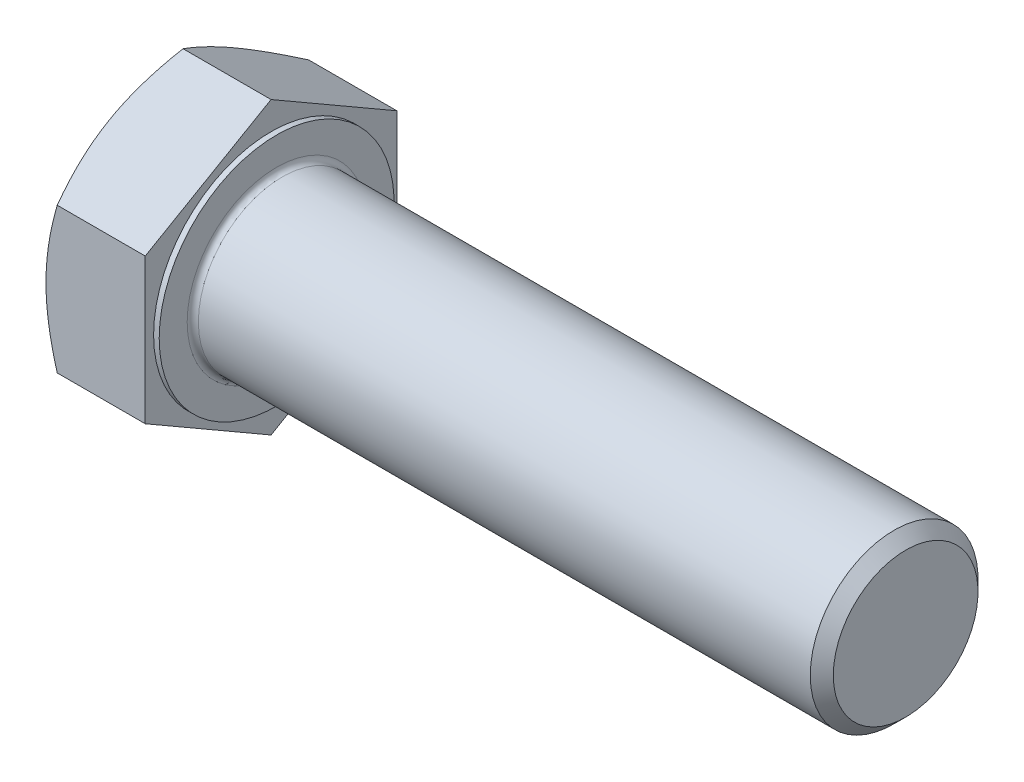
ISO-10303-21;
HEADER;
FILE_DESCRIPTION(('STEP AP214'),'2;1');
FILE_NAME('part.step','',(''),(''),'','','');
FILE_SCHEMA(('AUTOMOTIVE_DESIGN { 1 0 10303 214 1 1 1 1 }'));
ENDSEC;
DATA;
#1=APPLICATION_CONTEXT('core data for automotive mechanical design processes');
#2=APPLICATION_PROTOCOL_DEFINITION('international standard','automotive_design',2000,#1);
#3=PRODUCT_CONTEXT('',#1,'mechanical');
#4=PRODUCT('Part','Part','',(#3));
#5=PRODUCT_RELATED_PRODUCT_CATEGORY('part','',(#4));
#6=PRODUCT_DEFINITION_FORMATION('','',#4);
#7=PRODUCT_DEFINITION_CONTEXT('part definition',#1,'design');
#8=PRODUCT_DEFINITION('design','',#6,#7);
#9=PRODUCT_DEFINITION_SHAPE('','',#8);
#10=(LENGTH_UNIT() NAMED_UNIT(*) SI_UNIT(.MILLI.,.METRE.));
#11=(NAMED_UNIT(*) PLANE_ANGLE_UNIT() SI_UNIT($,.RADIAN.));
#12=(NAMED_UNIT(*) SI_UNIT($,.STERADIAN.) SOLID_ANGLE_UNIT());
#13=UNCERTAINTY_MEASURE_WITH_UNIT(LENGTH_MEASURE(1.E-05),#10,'distance_accuracy_value','');
#14=(GEOMETRIC_REPRESENTATION_CONTEXT(3) GLOBAL_UNCERTAINTY_ASSIGNED_CONTEXT((#13)) GLOBAL_UNIT_ASSIGNED_CONTEXT((#10,
#11,#12)) REPRESENTATION_CONTEXT('',''));
#15=CARTESIAN_POINT('',(0.,0.,0.));
#16=DIRECTION('',(0.,0.,1.));
#17=DIRECTION('',(1.,0.,0.));
#18=AXIS2_PLACEMENT_3D('',#15,#16,#17);
#19=CARTESIAN_POINT('',(15.,-31.1769145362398,-18.));
#20=DIRECTION('',(-1.,0.,0.));
#21=DIRECTION('',(0.,0.,1.));
#22=AXIS2_PLACEMENT_3D('',#19,#20,#21);
#23=PLANE('',#22);
#24=CARTESIAN_POINT('',(15.,0.,0.));
#25=DIRECTION('',(-1.,0.,0.));
#26=DIRECTION('',(0.,0.,1.));
#27=AXIS2_PLACEMENT_3D('',#24,#25,#26);
#28=CIRCLE('',#27,12.8);
#29=CARTESIAN_POINT('',(15.,0.,12.8));
#30=VERTEX_POINT('',#29);
#31=EDGE_CURVE('E11',#30,#30,#28,.T.);
#32=ORIENTED_EDGE('',*,*,#31,.T.);
#33=EDGE_LOOP('',(#32));
#34=FACE_BOUND('',#33,.T.);
#35=CARTESIAN_POINT('',(15.,0.,0.));
#36=DIRECTION('',(-1.,0.,0.));
#37=DIRECTION('',(0.,0.,1.));
#38=AXIS2_PLACEMENT_3D('',#35,#36,#37);
#39=CIRCLE('',#38,16.805);
#40=CARTESIAN_POINT('',(15.,0.,16.805));
#41=VERTEX_POINT('',#40);
#42=EDGE_CURVE('E274',#41,#41,#39,.T.);
#43=ORIENTED_EDGE('',*,*,#42,.F.);
#44=EDGE_LOOP('',(#43));
#45=FACE_BOUND('',#44,.T.);
#46=ADVANCED_FACE('F45',(#34,#45),#23,.F.);
#47=CARTESIAN_POINT('',(0.,0.,0.));
#48=DIRECTION('',(-1.,0.,0.));
#49=DIRECTION('',(0.,0.,1.));
#50=AXIS2_PLACEMENT_3D('',#47,#48,#49);
#51=CYLINDRICAL_SURFACE('',#50,12.);
#52=CARTESIAN_POINT('',(15.8,0.,0.));
#53=DIRECTION('',(-1.,0.,0.));
#54=DIRECTION('',(0.,0.,1.));
#55=AXIS2_PLACEMENT_3D('',#52,#53,#54);
#56=CIRCLE('',#55,12.);
#57=CARTESIAN_POINT('',(15.8,0.,12.));
#58=VERTEX_POINT('',#57);
#59=EDGE_CURVE('E53',#58,#58,#56,.F.);
#60=ORIENTED_EDGE('',*,*,#59,.T.);
#61=EDGE_LOOP('',(#60));
#62=FACE_BOUND('',#61,.T.);
#63=CARTESIAN_POINT('',(103.352,0.,0.));
#64=DIRECTION('',(-1.,0.,0.));
#65=DIRECTION('',(0.,0.,1.));
#66=AXIS2_PLACEMENT_3D('',#63,#64,#65);
#67=CIRCLE('',#66,12.);
#68=CARTESIAN_POINT('',(103.352,0.,12.));
#69=VERTEX_POINT('',#68);
#70=EDGE_CURVE('E290',#69,#69,#67,.T.);
#71=ORIENTED_EDGE('',*,*,#70,.T.);
#72=EDGE_LOOP('',(#71));
#73=FACE_BOUND('',#72,.T.);
#74=ADVANCED_FACE('F155',(#62,#73),#51,.T.);
#75=CARTESIAN_POINT('',(105.,0.,0.));
#76=DIRECTION('',(-1.,0.,0.));
#77=DIRECTION('',(0.,0.,1.));
#78=AXIS2_PLACEMENT_3D('',#75,#76,#77);
#79=PLANE('',#78);
#80=CARTESIAN_POINT('',(105.,0.,0.));
#81=DIRECTION('',(-1.,0.,0.));
#82=DIRECTION('',(0.,0.,1.));
#83=AXIS2_PLACEMENT_3D('',#80,#81,#82);
#84=CIRCLE('',#83,10.352);
#85=CARTESIAN_POINT('',(105.,0.,10.352));
#86=VERTEX_POINT('',#85);
#87=EDGE_CURVE('E312',#86,#86,#84,.T.);
#88=ORIENTED_EDGE('',*,*,#87,.F.);
#89=EDGE_LOOP('',(#88));
#90=FACE_BOUND('',#89,.T.);
#91=ADVANCED_FACE('F174',(#90),#79,.F.);
#92=CARTESIAN_POINT('',(105.,0.,0.));
#93=DIRECTION('',(-1.,0.,0.));
#94=DIRECTION('',(0.,0.,1.));
#95=AXIS2_PLACEMENT_3D('',#92,#93,#94);
#96=CONICAL_SURFACE('',#95,10.352,0.78539816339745);
#97=ORIENTED_EDGE('',*,*,#70,.F.);
#98=EDGE_LOOP('',(#97));
#99=FACE_BOUND('',#98,.T.);
#100=ORIENTED_EDGE('',*,*,#87,.T.);
#101=EDGE_LOOP('',(#100));
#102=FACE_BOUND('',#101,.T.);
#103=ADVANCED_FACE('F319',(#99,#102),#96,.T.);
#104=CARTESIAN_POINT('',(14.2,20.7846096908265,0.));
#105=DIRECTION('',(1.,0.,0.));
#106=DIRECTION('',(0.,0.,-1.));
#107=AXIS2_PLACEMENT_3D('',#104,#105,#106);
#108=PLANE('',#107);
#109=CARTESIAN_POINT('',(14.2,0.,0.));
#110=DIRECTION('',(-1.,0.,0.));
#111=DIRECTION('',(0.,0.,1.));
#112=AXIS2_PLACEMENT_3D('',#109,#110,#111);
#113=CIRCLE('',#112,16.805);
#114=CARTESIAN_POINT('',(14.2,0.,16.805));
#115=VERTEX_POINT('',#114);
#116=EDGE_CURVE('E271',#115,#115,#113,.T.);
#117=ORIENTED_EDGE('',*,*,#116,.T.);
#118=EDGE_LOOP('',(#117));
#119=FACE_BOUND('',#118,.T.);
#120=DIRECTION('',(0.,1.,0.));
#121=VECTOR('',#120,1.);
#122=CARTESIAN_POINT('',(14.2,-10.3923048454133,-18.));
#123=LINE('',#122,#121);
#124=CARTESIAN_POINT('',(14.2,-10.3923048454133,-18.));
#125=VERTEX_POINT('',#124);
#126=CARTESIAN_POINT('',(14.2,10.3923048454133,-18.));
#127=VERTEX_POINT('',#126);
#128=EDGE_CURVE('E278',#125,#127,#123,.T.);
#129=ORIENTED_EDGE('',*,*,#128,.T.);
#130=DIRECTION('',(0.,0.5,0.866025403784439));
#131=VECTOR('',#130,1.);
#132=CARTESIAN_POINT('',(14.2,10.3923048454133,-18.));
#133=LINE('',#132,#131);
#134=CARTESIAN_POINT('',(14.2,20.7846096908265,0.));
#135=VERTEX_POINT('',#134);
#136=EDGE_CURVE('E120',#127,#135,#133,.T.);
#137=ORIENTED_EDGE('',*,*,#136,.T.);
#138=DIRECTION('',(0.,-0.5,0.866025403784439));
#139=VECTOR('',#138,1.);
#140=CARTESIAN_POINT('',(14.2,20.7846096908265,0.));
#141=LINE('',#140,#139);
#142=CARTESIAN_POINT('',(14.2,10.3923048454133,18.));
#143=VERTEX_POINT('',#142);
#144=EDGE_CURVE('E115',#135,#143,#141,.T.);
#145=ORIENTED_EDGE('',*,*,#144,.T.);
#146=DIRECTION('',(0.,-1.,0.));
#147=VECTOR('',#146,1.);
#148=CARTESIAN_POINT('',(14.2,10.3923048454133,18.));
#149=LINE('',#148,#147);
#150=CARTESIAN_POINT('',(14.2,-10.3923048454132,18.));
#151=VERTEX_POINT('',#150);
#152=EDGE_CURVE('E118',#143,#151,#149,.T.);
#153=ORIENTED_EDGE('',*,*,#152,.T.);
#154=DIRECTION('',(0.,-0.5,-0.866025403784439));
#155=VECTOR('',#154,1.);
#156=CARTESIAN_POINT('',(14.2,-10.3923048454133,18.));
#157=LINE('',#156,#155);
#158=CARTESIAN_POINT('',(14.2,-20.7846096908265,0.));
#159=VERTEX_POINT('',#158);
#160=EDGE_CURVE('E60',#151,#159,#157,.T.);
#161=ORIENTED_EDGE('',*,*,#160,.T.);
#162=DIRECTION('',(0.,0.5,-0.866025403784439));
#163=VECTOR('',#162,1.);
#164=CARTESIAN_POINT('',(14.2,-20.7846096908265,0.));
#165=LINE('',#164,#163);
#166=EDGE_CURVE('E151',#159,#125,#165,.T.);
#167=ORIENTED_EDGE('',*,*,#166,.T.);
#168=EDGE_LOOP('',(#129,#137,#145,#153,#161,#167));
#169=FACE_BOUND('',#168,.T.);
#170=ADVANCED_FACE('F117',(#119,#169),#108,.T.);
#171=CARTESIAN_POINT('',(0.,0.,0.));
#172=DIRECTION('',(-1.,0.,0.));
#173=DIRECTION('',(0.,0.,1.));
#174=AXIS2_PLACEMENT_3D('',#171,#172,#173);
#175=CYLINDRICAL_SURFACE('',#174,16.805);
#176=ORIENTED_EDGE('',*,*,#42,.T.);
#177=EDGE_LOOP('',(#176));
#178=FACE_BOUND('',#177,.T.);
#179=ORIENTED_EDGE('',*,*,#116,.F.);
#180=EDGE_LOOP('',(#179));
#181=FACE_BOUND('',#180,.T.);
#182=ADVANCED_FACE('F184',(#178,#181),#175,.T.);
#183=CARTESIAN_POINT('',(0.,-31.1769145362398,-18.));
#184=DIRECTION('',(-1.,0.,0.));
#185=DIRECTION('',(0.,0.,1.));
#186=AXIS2_PLACEMENT_3D('',#183,#184,#185);
#187=PLANE('',#186);
#188=CARTESIAN_POINT('',(0.,0.,0.));
#189=DIRECTION('',(-1.,0.,0.));
#190=DIRECTION('',(0.,0.,1.));
#191=AXIS2_PLACEMENT_3D('',#188,#189,#190);
#192=CIRCLE('',#191,18.);
#193=CARTESIAN_POINT('',(0.,-15.5884572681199,9.));
#194=VERTEX_POINT('',#193);
#195=CARTESIAN_POINT('',(0.,0.,18.));
#196=VERTEX_POINT('',#195);
#197=EDGE_CURVE('E146',#194,#196,#192,.T.);
#198=ORIENTED_EDGE('',*,*,#197,.T.);
#199=CARTESIAN_POINT('',(0.,0.,0.));
#200=DIRECTION('',(-1.,0.,0.));
#201=DIRECTION('',(0.,0.,1.));
#202=AXIS2_PLACEMENT_3D('',#199,#200,#201);
#203=CIRCLE('',#202,18.);
#204=CARTESIAN_POINT('',(0.,15.5884572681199,9.));
#205=VERTEX_POINT('',#204);
#206=EDGE_CURVE('E68',#196,#205,#203,.T.);
#207=ORIENTED_EDGE('',*,*,#206,.T.);
#208=CARTESIAN_POINT('',(0.,15.5884572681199,-9.));
#209=VERTEX_POINT('',#208);
#210=EDGE_CURVE('E150',#205,#209,#192,.T.);
#211=ORIENTED_EDGE('',*,*,#210,.T.);
#212=CARTESIAN_POINT('',(0.,0.,-18.));
#213=VERTEX_POINT('',#212);
#214=EDGE_CURVE('E306',#209,#213,#192,.T.);
#215=ORIENTED_EDGE('',*,*,#214,.T.);
#216=CARTESIAN_POINT('',(0.,-15.5884572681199,-9.));
#217=VERTEX_POINT('',#216);
#218=EDGE_CURVE('E303',#213,#217,#192,.T.);
#219=ORIENTED_EDGE('',*,*,#218,.T.);
#220=EDGE_CURVE('E149',#217,#194,#192,.T.);
#221=ORIENTED_EDGE('',*,*,#220,.T.);
#222=EDGE_LOOP('',(#198,#207,#211,#215,#219,#221));
#223=FACE_BOUND('',#222,.T.);
#224=ADVANCED_FACE('F180',(#223),#187,.T.);
#225=CARTESIAN_POINT('',(0.,0.,0.));
#226=DIRECTION('',(1.,0.,0.));
#227=DIRECTION('',(0.,0.,-1.));
#228=AXIS2_PLACEMENT_3D('',#225,#226,#227);
#229=CONICAL_SURFACE('',#228,18.,1.0471975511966);
#230=CARTESIAN_POINT('',(1.60776182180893,20.7847251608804,0.000199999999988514));
#231=CARTESIAN_POINT('',(1.47589336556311,20.5563065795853,-0.395432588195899));
#232=CARTESIAN_POINT('',(1.35000889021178,20.3269970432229,-0.79260835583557));
#233=CARTESIAN_POINT('',(1.11187123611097,19.8665391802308,-1.59014476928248));
#234=CARTESIAN_POINT('',(0.999622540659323,19.6353902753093,-1.99050641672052));
#235=CARTESIAN_POINT('',(0.790265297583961,19.1708069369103,-2.79518836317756));
#236=CARTESIAN_POINT('',(0.693192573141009,18.9373684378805,-3.1995157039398));
#237=CARTESIAN_POINT('',(0.516271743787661,18.4688693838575,-4.01097986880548));
#238=CARTESIAN_POINT('',(0.43642265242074,18.2338089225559,-4.41811653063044));
#239=CARTESIAN_POINT('',(0.297345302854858,17.7680889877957,-5.22476711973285));
#240=CARTESIAN_POINT('',(0.237656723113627,17.537464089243,-5.62422116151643));
#241=CARTESIAN_POINT('',(0.13757237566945,17.0751575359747,-6.4249596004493));
#242=CARTESIAN_POINT('',(0.097176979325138,16.8434758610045,-6.82624403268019));
#243=CARTESIAN_POINT('',(0.0366989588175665,16.3797233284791,-7.62948698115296));
#244=CARTESIAN_POINT('',(0.0165921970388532,16.1476532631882,-8.03144412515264));
#245=CARTESIAN_POINT('',(-0.00287614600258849,15.6832989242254,-8.83572943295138));
#246=CARTESIAN_POINT('',(-0.00223836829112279,15.4510146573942,-9.23805758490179));
#247=CARTESIAN_POINT('',(0.0183335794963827,15.0167538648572,-9.99021934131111));
#248=CARTESIAN_POINT('',(0.0357591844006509,14.8147463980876,-10.3401065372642));
#249=CARTESIAN_POINT('',(0.0859690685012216,14.4112133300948,-11.0390463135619));
#250=CARTESIAN_POINT('',(0.118753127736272,14.209687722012,-11.3880989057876));
#251=CARTESIAN_POINT('',(0.199111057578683,13.8071947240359,-12.0852372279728));
#252=CARTESIAN_POINT('',(0.246698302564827,13.6062280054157,-12.4333217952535));
#253=CARTESIAN_POINT('',(0.355822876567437,13.2052512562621,-13.1278338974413));
#254=CARTESIAN_POINT('',(0.417360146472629,13.0052412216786,-13.4742614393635));
#255=CARTESIAN_POINT('',(0.624462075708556,12.3980849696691,-14.525886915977));
#256=CARTESIAN_POINT('',(0.790677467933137,11.99269701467,-15.228039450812));
#257=CARTESIAN_POINT('',(1.16791817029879,11.1879658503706,-16.6218747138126));
#258=CARTESIAN_POINT('',(1.37885488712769,10.78861233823,-17.3135752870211));
#259=CARTESIAN_POINT('',(1.60776182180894,10.3921893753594,-18.0002));
#260=B_SPLINE_CURVE_WITH_KNOTS('',3,(#230,#231,#232,#233,#234,#235,#236,#237,#238,#239,#240,
#241,#242,#243,#244,#245,#246,#247,#248,#249,#250,#251,#252,#253,#254,#255,#256,#257,#258,#259),
.UNSPECIFIED.,.F.,.F.,(4,2,2,2,2,2,2,2,2,2,2,2,2,2,4),(0.,1.42650335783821,2.85347447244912,
4.28376471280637,5.71397301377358,7.10888071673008,8.50381526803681,9.8970882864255,
11.2903182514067,12.5031974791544,13.7160593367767,14.9300201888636,16.1439758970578,
18.6253607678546,21.1018751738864),.UNSPECIFIED.);
#261=CARTESIAN_POINT('',(1.60769515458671,10.3923048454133,-18.));
#262=VERTEX_POINT('',#261);
#263=EDGE_CURVE('E238',#209,#262,#260,.T.);
#264=ORIENTED_EDGE('',*,*,#263,.T.);
#265=CARTESIAN_POINT('',(8.61348069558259,-27.5619239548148,-18.));
#266=CARTESIAN_POINT('',(8.42247770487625,-27.1667877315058,-18.));
#267=CARTESIAN_POINT('',(8.23246323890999,-26.7711739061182,-18.));
#268=CARTESIAN_POINT('',(7.85463825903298,-25.978890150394,-18.));
#269=CARTESIAN_POINT('',(7.66682776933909,-25.5822202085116,-18.));
#270=CARTESIAN_POINT('',(7.10698821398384,-24.3903587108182,-18.));
#271=CARTESIAN_POINT('',(6.73861331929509,-23.5934439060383,-18.));
#272=CARTESIAN_POINT('',(6.01187832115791,-21.9895471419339,-18.));
#273=CARTESIAN_POINT('',(5.65358759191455,-21.1825336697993,-18.));
#274=CARTESIAN_POINT('',(4.95238944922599,-19.5618746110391,-18.));
#275=CARTESIAN_POINT('',(4.60948123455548,-18.7482293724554,-18.));
#276=CARTESIAN_POINT('',(3.93907746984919,-17.1029123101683,-18.));
#277=CARTESIAN_POINT('',(3.611822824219,-16.2711418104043,-18.));
#278=CARTESIAN_POINT('',(2.98294292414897,-14.597784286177,-18.));
#279=CARTESIAN_POINT('',(2.68132051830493,-13.7561961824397,-18.));
#280=CARTESIAN_POINT('',(2.11181367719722,-12.0636207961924,-18.));
#281=CARTESIAN_POINT('',(1.84385751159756,-11.2126578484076,-18.));
#282=CARTESIAN_POINT('',(1.35037221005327,-9.49855213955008,-18.));
#283=CARTESIAN_POINT('',(1.12482967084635,-8.6354133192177,-18.));
#284=CARTESIAN_POINT('',(0.826582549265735,-7.33140916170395,-18.));
#285=CARTESIAN_POINT('',(0.733829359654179,-6.89509921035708,-18.));
#286=CARTESIAN_POINT('',(0.563143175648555,-6.01957542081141,-18.));
#287=CARTESIAN_POINT('',(0.485209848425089,-5.5803616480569,-18.));
#288=CARTESIAN_POINT('',(0.345545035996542,-4.6993249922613,-18.));
#289=CARTESIAN_POINT('',(0.283814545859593,-4.25750195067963,-18.));
#290=CARTESIAN_POINT('',(0.177795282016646,-3.37175302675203,-18.));
#291=CARTESIAN_POINT('',(0.133506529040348,-2.92782714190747,-18.));
#292=CARTESIAN_POINT('',(0.0635630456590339,-2.04133804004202,-18.));
#293=CARTESIAN_POINT('',(0.0377917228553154,-1.598784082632,-18.));
#294=CARTESIAN_POINT('',(0.00501858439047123,-0.71298392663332,-18.));
#295=CARTESIAN_POINT('',(-0.00198351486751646,-0.269737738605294,-18.));
#296=CARTESIAN_POINT('',(0.00294785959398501,0.616528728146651,-18.));
#297=CARTESIAN_POINT('',(0.0148760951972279,1.05954903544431,-18.));
#298=CARTESIAN_POINT('',(0.0573715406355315,1.9446967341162,-18.));
#299=CARTESIAN_POINT('',(0.0879395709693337,2.38682408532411,-18.));
#300=CARTESIAN_POINT('',(0.183949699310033,3.45808110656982,-18.));
#301=CARTESIAN_POINT('',(0.258712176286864,4.08639173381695,-18.));
#302=CARTESIAN_POINT('',(0.441718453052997,5.33809089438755,-18.));
#303=CARTESIAN_POINT('',(0.549967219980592,5.96147868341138,-18.));
#304=CARTESIAN_POINT('',(0.919513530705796,7.82534534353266,-18.));
#305=CARTESIAN_POINT('',(1.22536507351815,9.05709271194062,-18.));
#306=CARTESIAN_POINT('',(1.75275444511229,10.8995809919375,-18.));
#307=CARTESIAN_POINT('',(1.94256699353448,11.5199484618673,-18.));
#308=CARTESIAN_POINT('',(2.34111719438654,12.7546900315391,-18.));
#309=CARTESIAN_POINT('',(2.54985655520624,13.3690635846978,-18.));
#310=CARTESIAN_POINT('',(2.98181266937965,14.5887549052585,-18.));
#311=CARTESIAN_POINT('',(3.20494114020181,15.1941042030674,-18.));
#312=CARTESIAN_POINT('',(3.54929436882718,16.0983156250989,-18.));
#313=CARTESIAN_POINT('',(3.66566915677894,16.3990354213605,-18.));
#314=CARTESIAN_POINT('',(3.90137756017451,16.9993068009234,-18.));
#315=CARTESIAN_POINT('',(4.0207111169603,17.298858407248,-18.));
#316=CARTESIAN_POINT('',(4.14139052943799,17.5978664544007,-18.));
#317=B_SPLINE_CURVE_WITH_KNOTS('',3,(#265,#266,#267,#268,#269,#270,#271,#272,#273,#274,#275,
#276,#277,#278,#279,#280,#281,#282,#283,#284,#285,#286,#287,#288,#289,#290,#291,#292,#293,#294,
#295,#296,#297,#298,#299,#300,#301,#302,#303,#304,#305,#306,#307,#308,#309,#310,#311,#312,#313,
#314,#315,#316),.UNSPECIFIED.,.F.,.F.,(4,2,2,2,2,2,2,2,2,2,2,2,2,2,2,2,2,2,2,2,2,2,2,2,2,4),(0.,
1.3166344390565,2.6332833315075,5.26700924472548,7.91580691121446,10.5644664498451,
13.2456434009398,15.9271179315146,18.6027786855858,21.2775924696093,22.6155612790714,
23.9535000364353,25.2915209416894,26.6295434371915,27.9590656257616,29.2885677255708,
30.6177020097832,31.9468948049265,33.8440459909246,35.7414787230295,39.5436531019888,
41.4897689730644,43.4360606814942,45.3713764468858,46.3387197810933,47.3060439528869),.UNSPECIFIED.);
#318=EDGE_CURVE('E293',#262,#213,#317,.F.);
#319=ORIENTED_EDGE('',*,*,#318,.T.);
#320=ORIENTED_EDGE('',*,*,#214,.F.);
#321=EDGE_LOOP('',(#264,#319,#320));
#322=FACE_BOUND('',#321,.T.);
#323=ADVANCED_FACE('F183',(#322),#229,.T.);
#324=CARTESIAN_POINT('',(1.60776182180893,10.3921893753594,18.0002));
#325=CARTESIAN_POINT('',(1.47589336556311,10.6206079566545,17.6045674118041));
#326=CARTESIAN_POINT('',(1.35000889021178,10.8499174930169,17.2073916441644));
#327=CARTESIAN_POINT('',(1.11187123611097,11.310375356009,16.4098552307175));
#328=CARTESIAN_POINT('',(0.999622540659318,11.5415242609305,16.0094935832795));
#329=CARTESIAN_POINT('',(0.790265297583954,12.0061075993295,15.2048116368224));
#330=CARTESIAN_POINT('',(0.693192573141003,12.2395460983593,14.8004842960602));
#331=CARTESIAN_POINT('',(0.516271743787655,12.7080451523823,13.9890201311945));
#332=CARTESIAN_POINT('',(0.436422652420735,12.9431056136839,13.5818834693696));
#333=CARTESIAN_POINT('',(0.297345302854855,13.4088255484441,12.7752328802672));
#334=CARTESIAN_POINT('',(0.237656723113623,13.6394504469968,12.3757788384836));
#335=CARTESIAN_POINT('',(0.137572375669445,14.1017570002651,11.5750403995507));
#336=CARTESIAN_POINT('',(0.0971769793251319,14.3334386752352,11.1737559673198));
#337=CARTESIAN_POINT('',(0.0366989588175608,14.7971912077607,10.370513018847));
#338=CARTESIAN_POINT('',(0.0165921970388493,15.0292612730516,9.96855587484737));
#339=CARTESIAN_POINT('',(-0.00287614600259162,15.4936156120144,9.16427056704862));
#340=CARTESIAN_POINT('',(-0.0022383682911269,15.7258998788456,8.76194241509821));
#341=CARTESIAN_POINT('',(0.0183335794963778,16.1601606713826,8.00978065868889));
#342=CARTESIAN_POINT('',(0.0357591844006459,16.3621681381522,7.65989346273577));
#343=CARTESIAN_POINT('',(0.0859690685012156,16.765701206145,6.96095368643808));
#344=CARTESIAN_POINT('',(0.118753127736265,16.9672268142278,6.61190109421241));
#345=CARTESIAN_POINT('',(0.199111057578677,17.3697198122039,5.91476277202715));
#346=CARTESIAN_POINT('',(0.246698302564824,17.5706865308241,5.56667820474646));
#347=CARTESIAN_POINT('',(0.355822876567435,17.9716632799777,4.87216610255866));
#348=CARTESIAN_POINT('',(0.417360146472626,18.1716733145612,4.5257385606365));
#349=CARTESIAN_POINT('',(0.62446207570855,18.7788295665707,3.47411308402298));
#350=CARTESIAN_POINT('',(0.790677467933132,19.1842175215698,2.771960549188));
#351=CARTESIAN_POINT('',(1.16791817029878,19.9889486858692,1.37812528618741));
#352=CARTESIAN_POINT('',(1.37885488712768,20.3883021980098,0.686424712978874));
#353=CARTESIAN_POINT('',(1.60776182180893,20.7847251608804,-0.000200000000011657));
#354=B_SPLINE_CURVE_WITH_KNOTS('',3,(#324,#325,#326,#327,#328,#329,#330,#331,#332,#333,#334,
#335,#336,#337,#338,#339,#340,#341,#342,#343,#344,#345,#346,#347,#348,#349,#350,#351,#352,#353),
.UNSPECIFIED.,.F.,.F.,(4,2,2,2,2,2,2,2,2,2,2,2,2,2,4),(0.,1.42650335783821,2.85347447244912,
4.28376471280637,5.71397301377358,7.10888071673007,8.5038152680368,9.89708828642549,
11.2903182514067,12.5031974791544,13.7160593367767,14.9300201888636,16.1439758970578,
18.6253607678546,21.1018751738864),.UNSPECIFIED.);
#355=CARTESIAN_POINT('',(1.60769515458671,20.7846096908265,0.));
#356=VERTEX_POINT('',#355);
#357=EDGE_CURVE('E246',#205,#356,#354,.T.);
#358=ORIENTED_EDGE('',*,*,#357,.T.);
#359=EDGE_CURVE('E245',#356,#209,#260,.T.);
#360=ORIENTED_EDGE('',*,*,#359,.T.);
#361=ORIENTED_EDGE('',*,*,#210,.F.);
#362=EDGE_LOOP('',(#358,#360,#361));
#363=FACE_BOUND('',#362,.T.);
#364=ADVANCED_FACE('F218',(#363),#229,.T.);
#365=CARTESIAN_POINT('',(1.60769515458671,10.3923048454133,18.));
#366=VERTEX_POINT('',#365);
#367=EDGE_CURVE('E136',#366,#205,#354,.T.);
#368=ORIENTED_EDGE('',*,*,#367,.T.);
#369=ORIENTED_EDGE('',*,*,#206,.F.);
#370=CARTESIAN_POINT('',(8.61348069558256,-27.5619239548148,18.));
#371=CARTESIAN_POINT('',(8.42247770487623,-27.1667877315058,18.));
#372=CARTESIAN_POINT('',(8.23246323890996,-26.7711739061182,18.));
#373=CARTESIAN_POINT('',(7.85463825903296,-25.9788901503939,18.));
#374=CARTESIAN_POINT('',(7.66682776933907,-25.5822202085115,18.));
#375=CARTESIAN_POINT('',(7.10698821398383,-24.3903587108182,18.));
#376=CARTESIAN_POINT('',(6.73861331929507,-23.5934439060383,18.));
#377=CARTESIAN_POINT('',(6.01187832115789,-21.9895471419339,18.));
#378=CARTESIAN_POINT('',(5.65358759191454,-21.1825336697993,18.));
#379=CARTESIAN_POINT('',(4.95238944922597,-19.5618746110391,18.));
#380=CARTESIAN_POINT('',(4.60948123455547,-18.7482293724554,18.));
#381=CARTESIAN_POINT('',(3.93907746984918,-17.1029123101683,18.));
#382=CARTESIAN_POINT('',(3.61182282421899,-16.2711418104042,18.));
#383=CARTESIAN_POINT('',(2.98294292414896,-14.597784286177,18.));
#384=CARTESIAN_POINT('',(2.68132051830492,-13.7561961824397,18.));
#385=CARTESIAN_POINT('',(2.11181367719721,-12.0636207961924,18.));
#386=CARTESIAN_POINT('',(1.84385751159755,-11.2126578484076,18.));
#387=CARTESIAN_POINT('',(1.35037221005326,-9.49855213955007,18.));
#388=CARTESIAN_POINT('',(1.12482967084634,-8.63541331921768,18.));
#389=CARTESIAN_POINT('',(0.826582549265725,-7.33140916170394,18.));
#390=CARTESIAN_POINT('',(0.733829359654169,-6.89509921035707,18.));
#391=CARTESIAN_POINT('',(0.563143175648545,-6.0195754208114,18.));
#392=CARTESIAN_POINT('',(0.485209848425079,-5.58036164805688,18.));
#393=CARTESIAN_POINT('',(0.345545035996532,-4.69932499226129,18.));
#394=CARTESIAN_POINT('',(0.283814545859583,-4.25750195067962,18.));
#395=CARTESIAN_POINT('',(0.177795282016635,-3.37175302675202,18.));
#396=CARTESIAN_POINT('',(0.133506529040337,-2.92782714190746,18.));
#397=CARTESIAN_POINT('',(0.0635630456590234,-2.04133804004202,18.));
#398=CARTESIAN_POINT('',(0.0377917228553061,-1.59878408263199,18.));
#399=CARTESIAN_POINT('',(0.0050185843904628,-0.712983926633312,18.));
#400=CARTESIAN_POINT('',(-0.00198351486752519,-0.269737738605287,18.));
#401=CARTESIAN_POINT('',(0.00294785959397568,0.616528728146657,18.));
#402=CARTESIAN_POINT('',(0.0148760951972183,1.05954903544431,18.));
#403=CARTESIAN_POINT('',(0.0573715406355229,1.94469673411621,18.));
#404=CARTESIAN_POINT('',(0.0879395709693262,2.38682408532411,18.));
#405=CARTESIAN_POINT('',(0.183949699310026,3.45808110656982,18.));
#406=CARTESIAN_POINT('',(0.258712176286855,4.08639173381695,18.));
#407=CARTESIAN_POINT('',(0.441718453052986,5.33809089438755,18.));
#408=CARTESIAN_POINT('',(0.549967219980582,5.96147868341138,18.));
#409=CARTESIAN_POINT('',(0.919513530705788,7.82534534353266,18.));
#410=CARTESIAN_POINT('',(1.22536507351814,9.05709271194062,18.));
#411=CARTESIAN_POINT('',(1.75275444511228,10.8995809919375,18.));
#412=CARTESIAN_POINT('',(1.94256699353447,11.5199484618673,18.));
#413=CARTESIAN_POINT('',(2.34111719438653,12.7546900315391,18.));
#414=CARTESIAN_POINT('',(2.54985655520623,13.3690635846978,18.));
#415=CARTESIAN_POINT('',(2.98181266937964,14.5887549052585,18.));
#416=CARTESIAN_POINT('',(3.2049411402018,15.1941042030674,18.));
#417=CARTESIAN_POINT('',(3.54929436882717,16.0983156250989,18.));
#418=CARTESIAN_POINT('',(3.66566915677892,16.3990354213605,18.));
#419=CARTESIAN_POINT('',(3.9013775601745,16.9993068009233,18.));
#420=CARTESIAN_POINT('',(4.02071111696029,17.298858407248,18.));
#421=CARTESIAN_POINT('',(4.14139052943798,17.5978664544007,18.));
#422=B_SPLINE_CURVE_WITH_KNOTS('',3,(#370,#371,#372,#373,#374,#375,#376,#377,#378,#379,#380,
#381,#382,#383,#384,#385,#386,#387,#388,#389,#390,#391,#392,#393,#394,#395,#396,#397,#398,#399,
#400,#401,#402,#403,#404,#405,#406,#407,#408,#409,#410,#411,#412,#413,#414,#415,#416,#417,#418,
#419,#420,#421),.UNSPECIFIED.,.F.,.F.,(4,2,2,2,2,2,2,2,2,2,2,2,2,2,2,2,2,2,2,2,2,2,2,2,2,4),(0.,
1.31663443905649,2.6332833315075,5.26700924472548,7.91580691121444,10.5644664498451,
13.2456434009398,15.9271179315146,18.6027786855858,21.2775924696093,22.6155612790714,
23.9535000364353,25.2915209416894,26.6295434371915,27.9590656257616,29.2885677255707,
30.6177020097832,31.9468948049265,33.8440459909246,35.7414787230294,39.5436531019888,
41.4897689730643,43.4360606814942,45.3713764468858,46.3387197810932,47.3060439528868),.UNSPECIFIED.);
#423=EDGE_CURVE('E289',#196,#366,#422,.T.);
#424=ORIENTED_EDGE('',*,*,#423,.T.);
#425=EDGE_LOOP('',(#368,#369,#424));
#426=FACE_BOUND('',#425,.T.);
#427=ADVANCED_FACE('F213',(#426),#229,.T.);
#428=CARTESIAN_POINT('',(1.60769515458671,-10.3923048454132,18.));
#429=VERTEX_POINT('',#428);
#430=EDGE_CURVE('E232',#429,#196,#422,.T.);
#431=ORIENTED_EDGE('',*,*,#430,.T.);
#432=ORIENTED_EDGE('',*,*,#197,.F.);
#433=CARTESIAN_POINT('',(1.60776182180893,-20.7847251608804,-0.000200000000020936));
#434=CARTESIAN_POINT('',(1.47589336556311,-20.5563065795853,0.395432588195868));
#435=CARTESIAN_POINT('',(1.35000889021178,-20.3269970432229,0.79260835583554));
#436=CARTESIAN_POINT('',(1.11187123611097,-19.8665391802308,1.59014476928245));
#437=CARTESIAN_POINT('',(0.999622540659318,-19.6353902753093,1.99050641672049));
#438=CARTESIAN_POINT('',(0.790265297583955,-19.1708069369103,2.79518836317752));
#439=CARTESIAN_POINT('',(0.693192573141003,-18.9373684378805,3.19951570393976));
#440=CARTESIAN_POINT('',(0.516271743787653,-18.4688693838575,4.01097986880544));
#441=CARTESIAN_POINT('',(0.436422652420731,-18.2338089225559,4.4181165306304));
#442=CARTESIAN_POINT('',(0.297345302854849,-17.7680889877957,5.22476711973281));
#443=CARTESIAN_POINT('',(0.237656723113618,-17.537464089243,5.6242211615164));
#444=CARTESIAN_POINT('',(0.13757237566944,-17.0751575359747,6.42495960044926));
#445=CARTESIAN_POINT('',(0.0971769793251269,-16.8434758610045,6.82624403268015));
#446=CARTESIAN_POINT('',(0.0366989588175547,-16.3797233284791,7.62948698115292));
#447=CARTESIAN_POINT('',(0.0165921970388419,-16.1476532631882,8.03144412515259));
#448=CARTESIAN_POINT('',(-0.00287614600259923,-15.6832989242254,8.83572943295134));
#449=CARTESIAN_POINT('',(-0.00223836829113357,-15.4510146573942,9.23805758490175));
#450=CARTESIAN_POINT('',(0.0183335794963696,-15.0167538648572,9.99021934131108));
#451=CARTESIAN_POINT('',(0.0357591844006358,-14.8147463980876,10.3401065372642));
#452=CARTESIAN_POINT('',(0.0859690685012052,-14.4112133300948,11.0390463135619));
#453=CARTESIAN_POINT('',(0.118753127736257,-14.209687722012,11.3880989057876));
#454=CARTESIAN_POINT('',(0.199111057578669,-13.8071947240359,12.0852372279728));
#455=CARTESIAN_POINT('',(0.246698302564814,-13.6062280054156,12.4333217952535));
#456=CARTESIAN_POINT('',(0.355822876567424,-13.2052512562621,13.1278338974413));
#457=CARTESIAN_POINT('',(0.417360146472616,-13.0052412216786,13.4742614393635));
#458=CARTESIAN_POINT('',(0.624462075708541,-12.3980849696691,14.525886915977));
#459=CARTESIAN_POINT('',(0.790677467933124,-11.99269701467,15.228039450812));
#460=CARTESIAN_POINT('',(1.16791817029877,-11.1879658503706,16.6218747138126));
#461=CARTESIAN_POINT('',(1.37885488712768,-10.78861233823,17.3135752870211));
#462=CARTESIAN_POINT('',(1.60776182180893,-10.3921893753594,18.0002));
#463=B_SPLINE_CURVE_WITH_KNOTS('',3,(#433,#434,#435,#436,#437,#438,#439,#440,#441,#442,#443,
#444,#445,#446,#447,#448,#449,#450,#451,#452,#453,#454,#455,#456,#457,#458,#459,#460,#461,#462),
.UNSPECIFIED.,.F.,.F.,(4,2,2,2,2,2,2,2,2,2,2,2,2,2,4),(0.,1.42650335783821,2.85347447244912,
4.28376471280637,5.71397301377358,7.10888071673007,8.50381526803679,9.89708828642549,
11.2903182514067,12.5031974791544,13.7160593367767,14.9300201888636,16.1439758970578,
18.6253607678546,21.1018751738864),.UNSPECIFIED.);
#464=EDGE_CURVE('E291',#194,#429,#463,.T.);
#465=ORIENTED_EDGE('',*,*,#464,.T.);
#466=EDGE_LOOP('',(#431,#432,#465));
#467=FACE_BOUND('',#466,.T.);
#468=ADVANCED_FACE('F217',(#467),#229,.T.);
#469=CARTESIAN_POINT('',(1.60769515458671,-10.3923048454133,-18.));
#470=VERTEX_POINT('',#469);
#471=EDGE_CURVE('E226',#213,#470,#317,.F.);
#472=ORIENTED_EDGE('',*,*,#471,.T.);
#473=CARTESIAN_POINT('',(1.60776182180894,-10.3921893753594,-18.0002));
#474=CARTESIAN_POINT('',(1.47589336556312,-10.6206079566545,-17.6045674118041));
#475=CARTESIAN_POINT('',(1.35000889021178,-10.8499174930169,-17.2073916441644));
#476=CARTESIAN_POINT('',(1.11187123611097,-11.310375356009,-16.4098552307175));
#477=CARTESIAN_POINT('',(0.999622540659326,-11.5415242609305,-16.0094935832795));
#478=CARTESIAN_POINT('',(0.790265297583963,-12.0061075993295,-15.2048116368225));
#479=CARTESIAN_POINT('',(0.69319257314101,-12.2395460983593,-14.8004842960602));
#480=CARTESIAN_POINT('',(0.516271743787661,-12.7080451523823,-13.9890201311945));
#481=CARTESIAN_POINT('',(0.436422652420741,-12.9431056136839,-13.5818834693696));
#482=CARTESIAN_POINT('',(0.297345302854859,-13.4088255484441,-12.7752328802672));
#483=CARTESIAN_POINT('',(0.237656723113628,-13.6394504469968,-12.3757788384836));
#484=CARTESIAN_POINT('',(0.13757237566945,-14.1017570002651,-11.5750403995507));
#485=CARTESIAN_POINT('',(0.0971769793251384,-14.3334386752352,-11.1737559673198));
#486=CARTESIAN_POINT('',(0.0366989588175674,-14.7971912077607,-10.370513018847));
#487=CARTESIAN_POINT('',(0.0165921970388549,-15.0292612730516,-9.96855587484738));
#488=CARTESIAN_POINT('',(-0.00287614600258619,-15.4936156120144,-9.16427056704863));
#489=CARTESIAN_POINT('',(-0.00223836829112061,-15.7258998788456,-8.76194241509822));
#490=CARTESIAN_POINT('',(0.0183335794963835,-16.1601606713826,-8.00978065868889));
#491=CARTESIAN_POINT('',(0.0357591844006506,-16.3621681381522,-7.65989346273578));
#492=CARTESIAN_POINT('',(0.0859690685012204,-16.765701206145,-6.96095368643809));
#493=CARTESIAN_POINT('',(0.118753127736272,-16.9672268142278,-6.61190109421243));
#494=CARTESIAN_POINT('',(0.199111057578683,-17.3697198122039,-5.91476277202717));
#495=CARTESIAN_POINT('',(0.246698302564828,-17.5706865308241,-5.56667820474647));
#496=CARTESIAN_POINT('',(0.355822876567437,-17.9716632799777,-4.87216610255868));
#497=CARTESIAN_POINT('',(0.417360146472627,-18.1716733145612,-4.52573856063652));
#498=CARTESIAN_POINT('',(0.624462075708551,-18.7788295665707,-3.474113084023));
#499=CARTESIAN_POINT('',(0.790677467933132,-19.1842175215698,-2.77196054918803));
#500=CARTESIAN_POINT('',(1.16791817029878,-19.9889486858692,-1.37812528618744));
#501=CARTESIAN_POINT('',(1.37885488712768,-20.3883021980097,-0.686424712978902));
#502=CARTESIAN_POINT('',(1.60776182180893,-20.7847251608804,0.000199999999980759));
#503=B_SPLINE_CURVE_WITH_KNOTS('',3,(#473,#474,#475,#476,#477,#478,#479,#480,#481,#482,#483,
#484,#485,#486,#487,#488,#489,#490,#491,#492,#493,#494,#495,#496,#497,#498,#499,#500,#501,#502),
.UNSPECIFIED.,.F.,.F.,(4,2,2,2,2,2,2,2,2,2,2,2,2,2,4),(0.,1.42650335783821,2.85347447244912,
4.28376471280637,5.71397301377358,7.10888071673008,8.50381526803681,9.89708828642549,
11.2903182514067,12.5031974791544,13.7160593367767,14.9300201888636,16.1439758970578,
18.6253607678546,21.1018751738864),.UNSPECIFIED.);
#504=EDGE_CURVE('E205',#470,#217,#503,.T.);
#505=ORIENTED_EDGE('',*,*,#504,.T.);
#506=ORIENTED_EDGE('',*,*,#218,.F.);
#507=EDGE_LOOP('',(#472,#505,#506));
#508=FACE_BOUND('',#507,.T.);
#509=ADVANCED_FACE('F302',(#508),#229,.T.);
#510=CARTESIAN_POINT('',(1.60769515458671,-20.7846096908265,0.));
#511=VERTEX_POINT('',#510);
#512=EDGE_CURVE('E207',#511,#194,#463,.T.);
#513=ORIENTED_EDGE('',*,*,#512,.T.);
#514=ORIENTED_EDGE('',*,*,#220,.F.);
#515=EDGE_CURVE('E196',#217,#511,#503,.T.);
#516=ORIENTED_EDGE('',*,*,#515,.T.);
#517=EDGE_LOOP('',(#513,#514,#516));
#518=FACE_BOUND('',#517,.T.);
#519=ADVANCED_FACE('F191',(#518),#229,.T.);
#520=CARTESIAN_POINT('',(15.,-20.7846096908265,0.));
#521=DIRECTION('',(0.,0.866025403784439,0.5));
#522=DIRECTION('',(0.,-0.5,0.866025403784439));
#523=AXIS2_PLACEMENT_3D('',#520,#521,#522);
#524=PLANE('',#523);
#525=ORIENTED_EDGE('',*,*,#166,.F.);
#526=DIRECTION('',(-1.,0.,0.));
#527=VECTOR('',#526,1.);
#528=CARTESIAN_POINT('',(15.,-20.7846096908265,0.));
#529=LINE('',#528,#527);
#530=EDGE_CURVE('E141',#159,#511,#529,.T.);
#531=ORIENTED_EDGE('',*,*,#530,.T.);
#532=ORIENTED_EDGE('',*,*,#515,.F.);
#533=ORIENTED_EDGE('',*,*,#504,.F.);
#534=DIRECTION('',(-1.,0.,0.));
#535=VECTOR('',#534,1.);
#536=CARTESIAN_POINT('',(15.,-10.3923048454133,-18.));
#537=LINE('',#536,#535);
#538=EDGE_CURVE('E311',#125,#470,#537,.T.);
#539=ORIENTED_EDGE('',*,*,#538,.F.);
#540=EDGE_LOOP('',(#525,#531,#532,#533,#539));
#541=FACE_BOUND('',#540,.T.);
#542=ADVANCED_FACE('F186',(#541),#524,.F.);
#543=CARTESIAN_POINT('',(15.,-10.3923048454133,18.));
#544=DIRECTION('',(0.,0.866025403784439,-0.5));
#545=DIRECTION('',(0.,0.5,0.866025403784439));
#546=AXIS2_PLACEMENT_3D('',#543,#544,#545);
#547=PLANE('',#546);
#548=ORIENTED_EDGE('',*,*,#160,.F.);
#549=DIRECTION('',(-1.,0.,0.));
#550=VECTOR('',#549,1.);
#551=CARTESIAN_POINT('',(15.,-10.3923048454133,18.));
#552=LINE('',#551,#550);
#553=EDGE_CURVE('E131',#151,#429,#552,.T.);
#554=ORIENTED_EDGE('',*,*,#553,.T.);
#555=ORIENTED_EDGE('',*,*,#464,.F.);
#556=ORIENTED_EDGE('',*,*,#512,.F.);
#557=ORIENTED_EDGE('',*,*,#530,.F.);
#558=EDGE_LOOP('',(#548,#554,#555,#556,#557));
#559=FACE_BOUND('',#558,.T.);
#560=ADVANCED_FACE('F190',(#559),#547,.F.);
#561=CARTESIAN_POINT('',(15.,10.3923048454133,18.));
#562=DIRECTION('',(0.,0.,-1.));
#563=DIRECTION('',(-1.,0.,0.));
#564=AXIS2_PLACEMENT_3D('',#561,#562,#563);
#565=PLANE('',#564);
#566=ORIENTED_EDGE('',*,*,#152,.F.);
#567=DIRECTION('',(-1.,0.,0.));
#568=VECTOR('',#567,1.);
#569=CARTESIAN_POINT('',(15.,10.3923048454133,18.));
#570=LINE('',#569,#568);
#571=EDGE_CURVE('E129',#143,#366,#570,.T.);
#572=ORIENTED_EDGE('',*,*,#571,.T.);
#573=ORIENTED_EDGE('',*,*,#423,.F.);
#574=ORIENTED_EDGE('',*,*,#430,.F.);
#575=ORIENTED_EDGE('',*,*,#553,.F.);
#576=EDGE_LOOP('',(#566,#572,#573,#574,#575));
#577=FACE_BOUND('',#576,.T.);
#578=ADVANCED_FACE('F127',(#577),#565,.F.);
#579=CARTESIAN_POINT('',(15.,20.7846096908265,0.));
#580=DIRECTION('',(0.,-0.866025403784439,-0.5));
#581=DIRECTION('',(0.,0.5,-0.866025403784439));
#582=AXIS2_PLACEMENT_3D('',#579,#580,#581);
#583=PLANE('',#582);
#584=ORIENTED_EDGE('',*,*,#144,.F.);
#585=DIRECTION('',(-1.,0.,0.));
#586=VECTOR('',#585,1.);
#587=CARTESIAN_POINT('',(15.,20.7846096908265,0.));
#588=LINE('',#587,#586);
#589=EDGE_CURVE('E137',#135,#356,#588,.T.);
#590=ORIENTED_EDGE('',*,*,#589,.T.);
#591=ORIENTED_EDGE('',*,*,#357,.F.);
#592=ORIENTED_EDGE('',*,*,#367,.F.);
#593=ORIENTED_EDGE('',*,*,#571,.F.);
#594=EDGE_LOOP('',(#584,#590,#591,#592,#593));
#595=FACE_BOUND('',#594,.T.);
#596=ADVANCED_FACE('F134',(#595),#583,.F.);
#597=CARTESIAN_POINT('',(15.,10.3923048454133,-18.));
#598=DIRECTION('',(0.,-0.866025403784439,0.5));
#599=DIRECTION('',(0.,-0.5,-0.866025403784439));
#600=AXIS2_PLACEMENT_3D('',#597,#598,#599);
#601=PLANE('',#600);
#602=ORIENTED_EDGE('',*,*,#136,.F.);
#603=DIRECTION('',(-1.,0.,0.));
#604=VECTOR('',#603,1.);
#605=CARTESIAN_POINT('',(15.,10.3923048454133,-18.));
#606=LINE('',#605,#604);
#607=EDGE_CURVE('E139',#127,#262,#606,.T.);
#608=ORIENTED_EDGE('',*,*,#607,.T.);
#609=ORIENTED_EDGE('',*,*,#263,.F.);
#610=ORIENTED_EDGE('',*,*,#359,.F.);
#611=ORIENTED_EDGE('',*,*,#589,.F.);
#612=EDGE_LOOP('',(#602,#608,#609,#610,#611));
#613=FACE_BOUND('',#612,.T.);
#614=ADVANCED_FACE('F165',(#613),#601,.F.);
#615=CARTESIAN_POINT('',(15.,-10.3923048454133,-18.));
#616=DIRECTION('',(0.,0.,1.));
#617=DIRECTION('',(0.,-1.,0.));
#618=AXIS2_PLACEMENT_3D('',#615,#616,#617);
#619=PLANE('',#618);
#620=ORIENTED_EDGE('',*,*,#128,.F.);
#621=ORIENTED_EDGE('',*,*,#538,.T.);
#622=ORIENTED_EDGE('',*,*,#471,.F.);
#623=ORIENTED_EDGE('',*,*,#318,.F.);
#624=ORIENTED_EDGE('',*,*,#607,.F.);
#625=EDGE_LOOP('',(#620,#621,#622,#623,#624));
#626=FACE_BOUND('',#625,.T.);
#627=ADVANCED_FACE('F159',(#626),#619,.F.);
#628=CARTESIAN_POINT('',(15.8,0.,0.));
#629=DIRECTION('',(-1.,0.,0.));
#630=DIRECTION('',(0.,0.,1.));
#631=AXIS2_PLACEMENT_3D('',#628,#629,#630);
#632=TOROIDAL_SURFACE('',#631,12.8,0.8);
#633=ORIENTED_EDGE('',*,*,#31,.F.);
#634=EDGE_LOOP('',(#633));
#635=FACE_BOUND('',#634,.T.);
#636=ORIENTED_EDGE('',*,*,#59,.F.);
#637=EDGE_LOOP('',(#636));
#638=FACE_BOUND('',#637,.T.);
#639=ADVANCED_FACE('F47',(#635,#638),#632,.F.);
#640=CLOSED_SHELL('',(#46,#74,#91,#103,#170,#182,#224,#323,#364,#427,#468,#509,#519,#542,#560,
#578,#596,#614,#627,#639));
#641=MANIFOLD_SOLID_BREP('B2',#640);
#642=ADVANCED_BREP_SHAPE_REPRESENTATION('',(#18,#641),#14);
#643=SHAPE_DEFINITION_REPRESENTATION(#9,#642);
ENDSEC;
END-ISO-10303-21;
